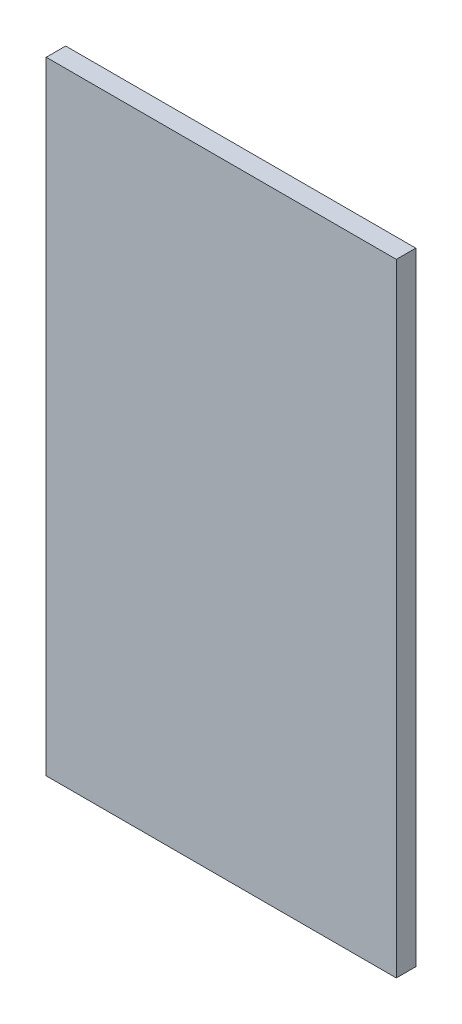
ISO-10303-21;
HEADER;
FILE_DESCRIPTION(('STEP AP214'),'2;1');
FILE_NAME('part.step','',(''),(''),'','','');
FILE_SCHEMA(('AUTOMOTIVE_DESIGN { 1 0 10303 214 1 1 1 1 }'));
ENDSEC;
DATA;
#1=APPLICATION_CONTEXT('core data for automotive mechanical design processes');
#2=APPLICATION_PROTOCOL_DEFINITION('international standard','automotive_design',2000,#1);
#3=PRODUCT_CONTEXT('',#1,'mechanical');
#4=PRODUCT('Part','Part','',(#3));
#5=PRODUCT_RELATED_PRODUCT_CATEGORY('part','',(#4));
#6=PRODUCT_DEFINITION_FORMATION('','',#4);
#7=PRODUCT_DEFINITION_CONTEXT('part definition',#1,'design');
#8=PRODUCT_DEFINITION('design','',#6,#7);
#9=PRODUCT_DEFINITION_SHAPE('','',#8);
#10=(LENGTH_UNIT() NAMED_UNIT(*) SI_UNIT(.MILLI.,.METRE.));
#11=(NAMED_UNIT(*) PLANE_ANGLE_UNIT() SI_UNIT($,.RADIAN.));
#12=(NAMED_UNIT(*) SI_UNIT($,.STERADIAN.) SOLID_ANGLE_UNIT());
#13=UNCERTAINTY_MEASURE_WITH_UNIT(LENGTH_MEASURE(1.E-05),#10,'distance_accuracy_value','');
#14=(GEOMETRIC_REPRESENTATION_CONTEXT(3) GLOBAL_UNCERTAINTY_ASSIGNED_CONTEXT((#13)) GLOBAL_UNIT_ASSIGNED_CONTEXT((#10,
#11,#12)) REPRESENTATION_CONTEXT('',''));
#15=CARTESIAN_POINT('',(0.,0.,0.));
#16=DIRECTION('',(0.,0.,1.));
#17=DIRECTION('',(1.,0.,0.));
#18=AXIS2_PLACEMENT_3D('',#15,#16,#17);
#19=CARTESIAN_POINT('',(0.,51.4949937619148,5.));
#20=DIRECTION('',(-1.,0.,0.));
#21=DIRECTION('',(0.,-1.,0.));
#22=AXIS2_PLACEMENT_3D('',#19,#20,#21);
#23=PLANE('',#22);
#24=DIRECTION('',(0.,1.,0.));
#25=VECTOR('',#24,1.);
#26=CARTESIAN_POINT('',(0.,51.4949937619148,0.));
#27=LINE('',#26,#25);
#28=CARTESIAN_POINT('',(0.,-108.505006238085,0.));
#29=VERTEX_POINT('',#28);
#30=CARTESIAN_POINT('',(0.,51.4949937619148,0.));
#31=VERTEX_POINT('',#30);
#32=EDGE_CURVE('E96',#29,#31,#27,.T.);
#33=ORIENTED_EDGE('',*,*,#32,.T.);
#34=DIRECTION('',(0.,0.,-1.));
#35=VECTOR('',#34,1.);
#36=CARTESIAN_POINT('',(0.,51.4949937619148,5.));
#37=LINE('',#36,#35);
#38=CARTESIAN_POINT('',(0.,51.4949937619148,5.));
#39=VERTEX_POINT('',#38);
#40=EDGE_CURVE('E11',#39,#31,#37,.T.);
#41=ORIENTED_EDGE('',*,*,#40,.F.);
#42=DIRECTION('',(0.,1.,0.));
#43=VECTOR('',#42,1.);
#44=CARTESIAN_POINT('',(0.,51.4949937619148,5.));
#45=LINE('',#44,#43);
#46=CARTESIAN_POINT('',(0.,-108.505006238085,5.));
#47=VERTEX_POINT('',#46);
#48=EDGE_CURVE('E84',#47,#39,#45,.T.);
#49=ORIENTED_EDGE('',*,*,#48,.F.);
#50=DIRECTION('',(0.,0.,-1.));
#51=VECTOR('',#50,1.);
#52=CARTESIAN_POINT('',(0.,-108.505006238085,5.));
#53=LINE('',#52,#51);
#54=EDGE_CURVE('E92',#47,#29,#53,.T.);
#55=ORIENTED_EDGE('',*,*,#54,.T.);
#56=EDGE_LOOP('',(#33,#41,#49,#55));
#57=FACE_BOUND('',#56,.T.);
#58=ADVANCED_FACE('F33',(#57),#23,.F.);
#59=CARTESIAN_POINT('',(-90.,51.4949937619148,5.));
#60=DIRECTION('',(0.,-1.,0.));
#61=DIRECTION('',(0.,0.,-1.));
#62=AXIS2_PLACEMENT_3D('',#59,#60,#61);
#63=PLANE('',#62);
#64=DIRECTION('',(-1.,0.,0.));
#65=VECTOR('',#64,1.);
#66=CARTESIAN_POINT('',(-90.,51.4949937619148,0.));
#67=LINE('',#66,#65);
#68=CARTESIAN_POINT('',(-90.,51.4949937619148,0.));
#69=VERTEX_POINT('',#68);
#70=EDGE_CURVE('E88',#31,#69,#67,.T.);
#71=ORIENTED_EDGE('',*,*,#70,.T.);
#72=DIRECTION('',(0.,0.,-1.));
#73=VECTOR('',#72,1.);
#74=CARTESIAN_POINT('',(-90.,51.4949937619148,5.));
#75=LINE('',#74,#73);
#76=CARTESIAN_POINT('',(-90.,51.4949937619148,5.));
#77=VERTEX_POINT('',#76);
#78=EDGE_CURVE('E41',#77,#69,#75,.T.);
#79=ORIENTED_EDGE('',*,*,#78,.F.);
#80=DIRECTION('',(-1.,0.,0.));
#81=VECTOR('',#80,1.);
#82=CARTESIAN_POINT('',(-90.,51.4949937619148,5.));
#83=LINE('',#82,#81);
#84=EDGE_CURVE('E79',#39,#77,#83,.T.);
#85=ORIENTED_EDGE('',*,*,#84,.F.);
#86=ORIENTED_EDGE('',*,*,#40,.T.);
#87=EDGE_LOOP('',(#71,#79,#85,#86));
#88=FACE_BOUND('',#87,.T.);
#89=ADVANCED_FACE('F87',(#88),#63,.F.);
#90=CARTESIAN_POINT('',(-90.,51.4949937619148,5.));
#91=DIRECTION('',(1.,0.,0.));
#92=DIRECTION('',(0.,0.,-1.));
#93=AXIS2_PLACEMENT_3D('',#90,#91,#92);
#94=PLANE('',#93);
#95=DIRECTION('',(0.,-1.,0.));
#96=VECTOR('',#95,1.);
#97=CARTESIAN_POINT('',(-90.,51.4949937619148,0.));
#98=LINE('',#97,#96);
#99=CARTESIAN_POINT('',(-90.,-108.505006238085,0.));
#100=VERTEX_POINT('',#99);
#101=EDGE_CURVE('E66',#69,#100,#98,.T.);
#102=ORIENTED_EDGE('',*,*,#101,.T.);
#103=DIRECTION('',(0.,0.,-1.));
#104=VECTOR('',#103,1.);
#105=CARTESIAN_POINT('',(-90.,-108.505006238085,5.));
#106=LINE('',#105,#104);
#107=CARTESIAN_POINT('',(-90.,-108.505006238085,5.));
#108=VERTEX_POINT('',#107);
#109=EDGE_CURVE('E89',#108,#100,#106,.T.);
#110=ORIENTED_EDGE('',*,*,#109,.F.);
#111=DIRECTION('',(0.,-1.,0.));
#112=VECTOR('',#111,1.);
#113=CARTESIAN_POINT('',(-90.,51.4949937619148,5.));
#114=LINE('',#113,#112);
#115=EDGE_CURVE('E82',#77,#108,#114,.T.);
#116=ORIENTED_EDGE('',*,*,#115,.F.);
#117=ORIENTED_EDGE('',*,*,#78,.T.);
#118=EDGE_LOOP('',(#102,#110,#116,#117));
#119=FACE_BOUND('',#118,.T.);
#120=ADVANCED_FACE('F90',(#119),#94,.F.);
#121=CARTESIAN_POINT('',(-90.,-108.505006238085,5.));
#122=DIRECTION('',(0.,1.,0.));
#123=DIRECTION('',(0.,0.,1.));
#124=AXIS2_PLACEMENT_3D('',#121,#122,#123);
#125=PLANE('',#124);
#126=DIRECTION('',(1.,0.,0.));
#127=VECTOR('',#126,1.);
#128=CARTESIAN_POINT('',(-90.,-108.505006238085,0.));
#129=LINE('',#128,#127);
#130=EDGE_CURVE('E72',#100,#29,#129,.T.);
#131=ORIENTED_EDGE('',*,*,#130,.T.);
#132=ORIENTED_EDGE('',*,*,#54,.F.);
#133=DIRECTION('',(1.,0.,0.));
#134=VECTOR('',#133,1.);
#135=CARTESIAN_POINT('',(-90.,-108.505006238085,5.));
#136=LINE('',#135,#134);
#137=EDGE_CURVE('E49',#108,#47,#136,.T.);
#138=ORIENTED_EDGE('',*,*,#137,.F.);
#139=ORIENTED_EDGE('',*,*,#109,.T.);
#140=EDGE_LOOP('',(#131,#132,#138,#139));
#141=FACE_BOUND('',#140,.T.);
#142=ADVANCED_FACE('F103',(#141),#125,.F.);
#143=CARTESIAN_POINT('',(0.,0.,5.));
#144=DIRECTION('',(0.,0.,1.));
#145=DIRECTION('',(1.,0.,0.));
#146=AXIS2_PLACEMENT_3D('',#143,#144,#145);
#147=PLANE('',#146);
#148=ORIENTED_EDGE('',*,*,#48,.T.);
#149=ORIENTED_EDGE('',*,*,#84,.T.);
#150=ORIENTED_EDGE('',*,*,#115,.T.);
#151=ORIENTED_EDGE('',*,*,#137,.T.);
#152=EDGE_LOOP('',(#148,#149,#150,#151));
#153=FACE_BOUND('',#152,.T.);
#154=ADVANCED_FACE('F80',(#153),#147,.T.);
#155=CARTESIAN_POINT('',(0.,0.,0.));
#156=DIRECTION('',(0.,0.,1.));
#157=DIRECTION('',(1.,0.,0.));
#158=AXIS2_PLACEMENT_3D('',#155,#156,#157);
#159=PLANE('',#158);
#160=ORIENTED_EDGE('',*,*,#32,.F.);
#161=ORIENTED_EDGE('',*,*,#130,.F.);
#162=ORIENTED_EDGE('',*,*,#101,.F.);
#163=ORIENTED_EDGE('',*,*,#70,.F.);
#164=EDGE_LOOP('',(#160,#161,#162,#163));
#165=FACE_BOUND('',#164,.T.);
#166=ADVANCED_FACE('F106',(#165),#159,.F.);
#167=CLOSED_SHELL('',(#58,#89,#120,#142,#154,#166));
#168=MANIFOLD_SOLID_BREP('B2',#167);
#169=ADVANCED_BREP_SHAPE_REPRESENTATION('',(#18,#168),#14);
#170=SHAPE_DEFINITION_REPRESENTATION(#9,#169);
ENDSEC;
END-ISO-10303-21;
